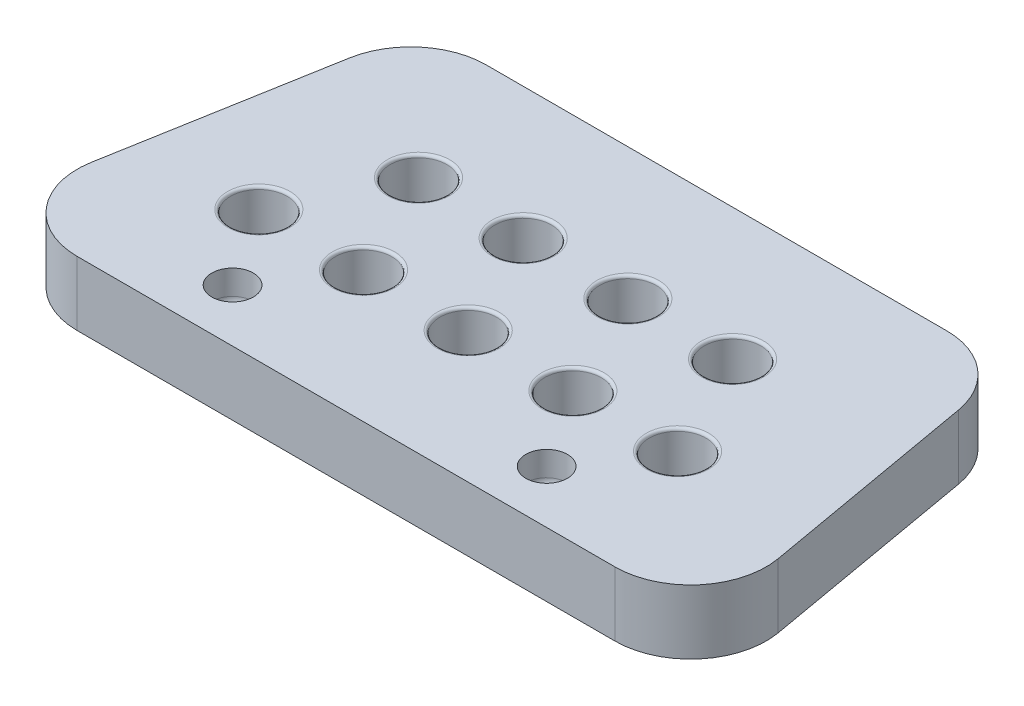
ISO-10303-21;
HEADER;
FILE_DESCRIPTION(('STEP AP214'),'2;1');
FILE_NAME('part.step','',(''),(''),'','','');
FILE_SCHEMA(('AUTOMOTIVE_DESIGN { 1 0 10303 214 1 1 1 1 }'));
ENDSEC;
DATA;
#1=APPLICATION_CONTEXT('core data for automotive mechanical design processes');
#2=APPLICATION_PROTOCOL_DEFINITION('international standard','automotive_design',2000,#1);
#3=PRODUCT_CONTEXT('',#1,'mechanical');
#4=PRODUCT('Part','Part','',(#3));
#5=PRODUCT_RELATED_PRODUCT_CATEGORY('part','',(#4));
#6=PRODUCT_DEFINITION_FORMATION('','',#4);
#7=PRODUCT_DEFINITION_CONTEXT('part definition',#1,'design');
#8=PRODUCT_DEFINITION('design','',#6,#7);
#9=PRODUCT_DEFINITION_SHAPE('','',#8);
#10=(LENGTH_UNIT() NAMED_UNIT(*) SI_UNIT(.MILLI.,.METRE.));
#11=(NAMED_UNIT(*) PLANE_ANGLE_UNIT() SI_UNIT($,.RADIAN.));
#12=(NAMED_UNIT(*) SI_UNIT($,.STERADIAN.) SOLID_ANGLE_UNIT());
#13=UNCERTAINTY_MEASURE_WITH_UNIT(LENGTH_MEASURE(1.E-05),#10,'distance_accuracy_value','');
#14=(GEOMETRIC_REPRESENTATION_CONTEXT(3) GLOBAL_UNCERTAINTY_ASSIGNED_CONTEXT((#13)) GLOBAL_UNIT_ASSIGNED_CONTEXT((#10,
#11,#12)) REPRESENTATION_CONTEXT('',''));
#15=CARTESIAN_POINT('',(0.,0.,0.));
#16=DIRECTION('',(0.,0.,1.));
#17=DIRECTION('',(1.,0.,0.));
#18=AXIS2_PLACEMENT_3D('',#15,#16,#17);
#19=CARTESIAN_POINT('',(-7.74413500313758,-5.15,2.78906652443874));
#20=DIRECTION('',(-0.17364817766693,0.,0.984807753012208));
#21=DIRECTION('',(0.984807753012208,0.,0.17364817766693));
#22=AXIS2_PLACEMENT_3D('',#19,#20,#21);
#23=CYLINDRICAL_SURFACE('',#22,0.1);
#24=CARTESIAN_POINT('',(-6.87292871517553,-5.15,-2.15178985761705));
#25=DIRECTION('',(-0.173648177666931,0.,0.984807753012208));
#26=DIRECTION('',(-0.984807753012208,0.,-0.173648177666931));
#27=AXIS2_PLACEMENT_3D('',#24,#25,#26);
#28=CIRCLE('',#27,0.1);
#29=CARTESIAN_POINT('',(-6.87292871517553,-5.25,-2.15178985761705));
#30=VERTEX_POINT('',#29);
#31=CARTESIAN_POINT('',(-6.97140949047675,-5.15,-2.16915467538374));
#32=VERTEX_POINT('',#31);
#33=EDGE_CURVE('E343',#30,#32,#28,.F.);
#34=ORIENTED_EDGE('',*,*,#33,.F.);
#35=DIRECTION('',(-0.173648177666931,0.,0.984807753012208));
#36=VECTOR('',#35,1.);
#37=CARTESIAN_POINT('',(-6.87292871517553,-5.25,-2.15178985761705));
#38=LINE('',#37,#36);
#39=CARTESIAN_POINT('',(-7.5429712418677,-5.25,1.64821014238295));
#40=VERTEX_POINT('',#39);
#41=EDGE_CURVE('E227',#30,#40,#38,.T.);
#42=ORIENTED_EDGE('',*,*,#41,.T.);
#43=CARTESIAN_POINT('',(-7.5429712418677,-5.15,1.64821014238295));
#44=DIRECTION('',(-0.173648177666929,0.,0.984807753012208));
#45=DIRECTION('',(-0.984807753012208,0.,-0.173648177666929));
#46=AXIS2_PLACEMENT_3D('',#43,#44,#45);
#47=CIRCLE('',#46,0.1);
#48=CARTESIAN_POINT('',(-7.64145201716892,-5.15,1.63084532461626));
#49=VERTEX_POINT('',#48);
#50=EDGE_CURVE('E408',#49,#40,#47,.T.);
#51=ORIENTED_EDGE('',*,*,#50,.F.);
#52=DIRECTION('',(-0.173648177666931,0.,0.984807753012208));
#53=VECTOR('',#52,1.);
#54=CARTESIAN_POINT('',(-7.64145201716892,-5.15,1.63084532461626));
#55=LINE('',#54,#53);
#56=EDGE_CURVE('E130',#32,#49,#55,.T.);
#57=ORIENTED_EDGE('',*,*,#56,.F.);
#58=EDGE_LOOP('',(#34,#42,#51,#57));
#59=FACE_BOUND('',#58,.T.);
#60=ADVANCED_FACE('F19',(#59),#23,.T.);
#61=CARTESIAN_POINT('',(-6.115,-5.15,1.9));
#62=DIRECTION('',(0.,1.,0.));
#63=DIRECTION('',(0.,0.,1.));
#64=AXIS2_PLACEMENT_3D('',#61,#62,#63);
#65=TOROIDAL_SURFACE('',#64,1.45,0.1);
#66=ORIENTED_EDGE('',*,*,#50,.T.);
#67=CARTESIAN_POINT('',(-6.115,-5.25,1.9));
#68=DIRECTION('',(0.,1.,0.));
#69=DIRECTION('',(-0.984807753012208,0.,-0.17364817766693));
#70=AXIS2_PLACEMENT_3D('',#67,#68,#69);
#71=CIRCLE('',#70,1.45);
#72=CARTESIAN_POINT('',(-6.115,-5.25,3.35));
#73=VERTEX_POINT('',#72);
#74=EDGE_CURVE('E168',#40,#73,#71,.T.);
#75=ORIENTED_EDGE('',*,*,#74,.T.);
#76=CARTESIAN_POINT('',(-6.115,-5.15,3.35));
#77=DIRECTION('',(1.,0.,0.));
#78=DIRECTION('',(0.,0.,-1.));
#79=AXIS2_PLACEMENT_3D('',#76,#77,#78);
#80=CIRCLE('',#79,0.1);
#81=CARTESIAN_POINT('',(-6.115,-5.15,3.45));
#82=VERTEX_POINT('',#81);
#83=EDGE_CURVE('E403',#82,#73,#80,.T.);
#84=ORIENTED_EDGE('',*,*,#83,.F.);
#85=CARTESIAN_POINT('',(-6.115,-5.15,1.9));
#86=DIRECTION('',(0.,-1.,0.));
#87=DIRECTION('',(0.,0.,-1.));
#88=AXIS2_PLACEMENT_3D('',#85,#86,#87);
#89=CIRCLE('',#88,1.55);
#90=EDGE_CURVE('E317',#49,#82,#89,.F.);
#91=ORIENTED_EDGE('',*,*,#90,.F.);
#92=EDGE_LOOP('',(#66,#75,#84,#91));
#93=FACE_BOUND('',#92,.T.);
#94=ADVANCED_FACE('F414',(#93),#65,.T.);
#95=CARTESIAN_POINT('',(-7.115,-5.15,3.35));
#96=DIRECTION('',(1.,0.,0.));
#97=DIRECTION('',(0.,0.,-1.));
#98=AXIS2_PLACEMENT_3D('',#95,#96,#97);
#99=CYLINDRICAL_SURFACE('',#98,0.1);
#100=ORIENTED_EDGE('',*,*,#83,.T.);
#101=DIRECTION('',(1.,0.,0.));
#102=VECTOR('',#101,1.);
#103=CARTESIAN_POINT('',(-7.115,-5.25,3.35));
#104=LINE('',#103,#102);
#105=CARTESIAN_POINT('',(6.115,-5.25,3.35));
#106=VERTEX_POINT('',#105);
#107=EDGE_CURVE('E245',#73,#106,#104,.T.);
#108=ORIENTED_EDGE('',*,*,#107,.T.);
#109=CARTESIAN_POINT('',(6.115,-5.15,3.35));
#110=DIRECTION('',(1.,0.,0.));
#111=DIRECTION('',(0.,0.,1.));
#112=AXIS2_PLACEMENT_3D('',#109,#110,#111);
#113=CIRCLE('',#112,0.1);
#114=CARTESIAN_POINT('',(6.115,-5.15,3.45));
#115=VERTEX_POINT('',#114);
#116=EDGE_CURVE('E379',#115,#106,#113,.T.);
#117=ORIENTED_EDGE('',*,*,#116,.F.);
#118=DIRECTION('',(1.,0.,0.));
#119=VECTOR('',#118,1.);
#120=CARTESIAN_POINT('',(6.115,-5.15,3.45));
#121=LINE('',#120,#119);
#122=EDGE_CURVE('E342',#82,#115,#121,.T.);
#123=ORIENTED_EDGE('',*,*,#122,.F.);
#124=EDGE_LOOP('',(#100,#108,#117,#123));
#125=FACE_BOUND('',#124,.T.);
#126=ADVANCED_FACE('F390',(#125),#99,.T.);
#127=CARTESIAN_POINT('',(6.115,-5.15,1.9));
#128=DIRECTION('',(0.,1.,0.));
#129=DIRECTION('',(0.,0.,1.));
#130=AXIS2_PLACEMENT_3D('',#127,#128,#129);
#131=TOROIDAL_SURFACE('',#130,1.45,0.1);
#132=CARTESIAN_POINT('',(7.5429712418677,-5.15,1.64821014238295));
#133=DIRECTION('',(-0.17364817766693,0.,-0.984807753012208));
#134=DIRECTION('',(-0.984807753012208,0.,0.17364817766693));
#135=AXIS2_PLACEMENT_3D('',#132,#133,#134);
#136=CIRCLE('',#135,0.1);
#137=CARTESIAN_POINT('',(7.64145201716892,-5.15,1.63084532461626));
#138=VERTEX_POINT('',#137);
#139=CARTESIAN_POINT('',(7.5429712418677,-5.25,1.64821014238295));
#140=VERTEX_POINT('',#139);
#141=EDGE_CURVE('E374',#138,#140,#136,.T.);
#142=ORIENTED_EDGE('',*,*,#141,.F.);
#143=CARTESIAN_POINT('',(6.115,-5.15,1.9));
#144=DIRECTION('',(0.,-1.,0.));
#145=DIRECTION('',(0.,0.,-1.));
#146=AXIS2_PLACEMENT_3D('',#143,#144,#145);
#147=CIRCLE('',#146,1.55);
#148=EDGE_CURVE('E284',#115,#138,#147,.F.);
#149=ORIENTED_EDGE('',*,*,#148,.F.);
#150=ORIENTED_EDGE('',*,*,#116,.T.);
#151=CARTESIAN_POINT('',(6.115,-5.25,1.9));
#152=DIRECTION('',(0.,1.,0.));
#153=DIRECTION('',(0.,0.,1.));
#154=AXIS2_PLACEMENT_3D('',#151,#152,#153);
#155=CIRCLE('',#154,1.45);
#156=EDGE_CURVE('E242',#106,#140,#155,.T.);
#157=ORIENTED_EDGE('',*,*,#156,.T.);
#158=EDGE_LOOP('',(#142,#149,#150,#157));
#159=FACE_BOUND('',#158,.T.);
#160=ADVANCED_FACE('F386',(#159),#131,.T.);
#161=CARTESIAN_POINT('',(7.31504800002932,-5.15,0.355593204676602));
#162=DIRECTION('',(-0.17364817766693,0.,-0.984807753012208));
#163=DIRECTION('',(-0.984807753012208,0.,0.17364817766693));
#164=AXIS2_PLACEMENT_3D('',#161,#162,#163);
#165=CYLINDRICAL_SURFACE('',#164,0.1);
#166=CARTESIAN_POINT('',(6.87292871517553,-5.15,-2.15178985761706));
#167=DIRECTION('',(-0.173648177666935,0.,-0.984807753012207));
#168=DIRECTION('',(0.984807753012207,0.,-0.173648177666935));
#169=AXIS2_PLACEMENT_3D('',#166,#167,#168);
#170=CIRCLE('',#169,0.1);
#171=CARTESIAN_POINT('',(6.97140949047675,-5.15,-2.16915467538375));
#172=VERTEX_POINT('',#171);
#173=CARTESIAN_POINT('',(6.87292871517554,-5.25,-2.15178985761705));
#174=VERTEX_POINT('',#173);
#175=EDGE_CURVE('E351',#172,#174,#170,.T.);
#176=ORIENTED_EDGE('',*,*,#175,.F.);
#177=DIRECTION('',(-0.173648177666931,0.,-0.984807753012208));
#178=VECTOR('',#177,1.);
#179=CARTESIAN_POINT('',(6.97140949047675,-5.15,-2.16915467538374));
#180=LINE('',#179,#178);
#181=EDGE_CURVE('E295',#138,#172,#180,.T.);
#182=ORIENTED_EDGE('',*,*,#181,.F.);
#183=ORIENTED_EDGE('',*,*,#141,.T.);
#184=DIRECTION('',(-0.173648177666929,0.,-0.984807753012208));
#185=VECTOR('',#184,1.);
#186=CARTESIAN_POINT('',(7.5429712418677,-5.25,1.64821014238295));
#187=LINE('',#186,#185);
#188=EDGE_CURVE('E236',#140,#174,#187,.T.);
#189=ORIENTED_EDGE('',*,*,#188,.T.);
#190=EDGE_LOOP('',(#176,#182,#183,#189));
#191=FACE_BOUND('',#190,.T.);
#192=ADVANCED_FACE('F361',(#191),#165,.T.);
#193=CARTESIAN_POINT('',(5.44495747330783,-5.15,-1.9));
#194=DIRECTION('',(0.,1.,0.));
#195=DIRECTION('',(0.,0.,1.));
#196=AXIS2_PLACEMENT_3D('',#193,#194,#195);
#197=TOROIDAL_SURFACE('',#196,1.45,0.1);
#198=CARTESIAN_POINT('',(5.44495747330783,-5.15,-3.35));
#199=DIRECTION('',(-1.,0.,0.));
#200=DIRECTION('',(0.,0.,1.));
#201=AXIS2_PLACEMENT_3D('',#198,#199,#200);
#202=CIRCLE('',#201,0.1);
#203=CARTESIAN_POINT('',(5.44495747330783,-5.15,-3.45));
#204=VERTEX_POINT('',#203);
#205=CARTESIAN_POINT('',(5.44495747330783,-5.25,-3.35));
#206=VERTEX_POINT('',#205);
#207=EDGE_CURVE('E347',#204,#206,#202,.T.);
#208=ORIENTED_EDGE('',*,*,#207,.F.);
#209=CARTESIAN_POINT('',(5.44495747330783,-5.15,-1.9));
#210=DIRECTION('',(0.,-1.,0.));
#211=DIRECTION('',(0.,0.,-1.));
#212=AXIS2_PLACEMENT_3D('',#209,#210,#211);
#213=CIRCLE('',#212,1.55);
#214=EDGE_CURVE('E301',#172,#204,#213,.F.);
#215=ORIENTED_EDGE('',*,*,#214,.F.);
#216=ORIENTED_EDGE('',*,*,#175,.T.);
#217=CARTESIAN_POINT('',(5.44495747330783,-5.25,-1.9));
#218=DIRECTION('',(0.,1.,0.));
#219=DIRECTION('',(0.984807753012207,0.,-0.173648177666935));
#220=AXIS2_PLACEMENT_3D('',#217,#218,#219);
#221=CIRCLE('',#220,1.45);
#222=EDGE_CURVE('E212',#174,#206,#221,.T.);
#223=ORIENTED_EDGE('',*,*,#222,.T.);
#224=EDGE_LOOP('',(#208,#215,#216,#223));
#225=FACE_BOUND('',#224,.T.);
#226=ADVANCED_FACE('F357',(#225),#197,.T.);
#227=CARTESIAN_POINT('',(-7.115,-5.15,-3.35));
#228=DIRECTION('',(-1.,0.,0.));
#229=DIRECTION('',(0.,0.,1.));
#230=AXIS2_PLACEMENT_3D('',#227,#228,#229);
#231=CYLINDRICAL_SURFACE('',#230,0.1);
#232=ORIENTED_EDGE('',*,*,#207,.T.);
#233=DIRECTION('',(1.,0.,0.));
#234=VECTOR('',#233,1.);
#235=CARTESIAN_POINT('',(-7.115,-5.25,-3.35));
#236=LINE('',#235,#234);
#237=CARTESIAN_POINT('',(-5.44495747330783,-5.25,-3.35));
#238=VERTEX_POINT('',#237);
#239=EDGE_CURVE('E224',#206,#238,#236,.F.);
#240=ORIENTED_EDGE('',*,*,#239,.T.);
#241=CARTESIAN_POINT('',(-5.44495747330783,-5.15,-3.35));
#242=DIRECTION('',(-1.,0.,0.));
#243=DIRECTION('',(0.,0.,-1.));
#244=AXIS2_PLACEMENT_3D('',#241,#242,#243);
#245=CIRCLE('',#244,0.1);
#246=CARTESIAN_POINT('',(-5.44495747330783,-5.15,-3.45));
#247=VERTEX_POINT('',#246);
#248=EDGE_CURVE('E335',#247,#238,#245,.T.);
#249=ORIENTED_EDGE('',*,*,#248,.F.);
#250=DIRECTION('',(-1.,0.,0.));
#251=VECTOR('',#250,1.);
#252=CARTESIAN_POINT('',(-5.44495747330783,-5.15,-3.45));
#253=LINE('',#252,#251);
#254=EDGE_CURVE('E307',#204,#247,#253,.T.);
#255=ORIENTED_EDGE('',*,*,#254,.F.);
#256=EDGE_LOOP('',(#232,#240,#249,#255));
#257=FACE_BOUND('',#256,.T.);
#258=ADVANCED_FACE('F329',(#257),#231,.T.);
#259=CARTESIAN_POINT('',(-5.44495747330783,-5.15,-1.9));
#260=DIRECTION('',(0.,1.,0.));
#261=DIRECTION('',(0.,0.,1.));
#262=AXIS2_PLACEMENT_3D('',#259,#260,#261);
#263=TOROIDAL_SURFACE('',#262,1.45,0.1);
#264=ORIENTED_EDGE('',*,*,#248,.T.);
#265=CARTESIAN_POINT('',(-5.44495747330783,-5.25,-1.9));
#266=DIRECTION('',(0.,1.,0.));
#267=DIRECTION('',(0.,0.,-1.));
#268=AXIS2_PLACEMENT_3D('',#265,#266,#267);
#269=CIRCLE('',#268,1.45);
#270=EDGE_CURVE('E145',#238,#30,#269,.T.);
#271=ORIENTED_EDGE('',*,*,#270,.T.);
#272=ORIENTED_EDGE('',*,*,#33,.T.);
#273=CARTESIAN_POINT('',(-5.44495747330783,-5.15,-1.9));
#274=DIRECTION('',(0.,-1.,0.));
#275=DIRECTION('',(0.,0.,-1.));
#276=AXIS2_PLACEMENT_3D('',#273,#274,#275);
#277=CIRCLE('',#276,1.55);
#278=EDGE_CURVE('E131',#247,#32,#277,.F.);
#279=ORIENTED_EDGE('',*,*,#278,.F.);
#280=EDGE_LOOP('',(#264,#271,#272,#279));
#281=FACE_BOUND('',#280,.T.);
#282=ADVANCED_FACE('F323',(#281),#263,.T.);
#283=CARTESIAN_POINT('',(6.115,-4.,3.45));
#284=DIRECTION('',(0.,0.,1.));
#285=DIRECTION('',(1.,0.,0.));
#286=AXIS2_PLACEMENT_3D('',#283,#284,#285);
#287=PLANE('',#286);
#288=DIRECTION('',(0.,-1.,0.));
#289=VECTOR('',#288,1.);
#290=CARTESIAN_POINT('',(6.115,-4.,3.45));
#291=LINE('',#290,#289);
#292=CARTESIAN_POINT('',(6.115,-4.,3.45));
#293=VERTEX_POINT('',#292);
#294=EDGE_CURVE('E287',#293,#115,#291,.T.);
#295=ORIENTED_EDGE('',*,*,#294,.F.);
#296=DIRECTION('',(1.,0.,0.));
#297=VECTOR('',#296,1.);
#298=CARTESIAN_POINT('',(-7.115,-4.,3.45));
#299=LINE('',#298,#297);
#300=CARTESIAN_POINT('',(-6.115,-4.,3.45));
#301=VERTEX_POINT('',#300);
#302=EDGE_CURVE('E109',#293,#301,#299,.F.);
#303=ORIENTED_EDGE('',*,*,#302,.T.);
#304=DIRECTION('',(0.,-1.,0.));
#305=VECTOR('',#304,1.);
#306=CARTESIAN_POINT('',(-6.115,-4.,3.45));
#307=LINE('',#306,#305);
#308=EDGE_CURVE('E121',#82,#301,#307,.F.);
#309=ORIENTED_EDGE('',*,*,#308,.F.);
#310=ORIENTED_EDGE('',*,*,#122,.T.);
#311=EDGE_LOOP('',(#295,#303,#309,#310));
#312=FACE_BOUND('',#311,.T.);
#313=ADVANCED_FACE('F328',(#312),#287,.T.);
#314=CARTESIAN_POINT('',(-6.115,-4.,1.9));
#315=DIRECTION('',(0.,-1.,0.));
#316=DIRECTION('',(0.,0.,-1.));
#317=AXIS2_PLACEMENT_3D('',#314,#315,#316);
#318=CYLINDRICAL_SURFACE('',#317,1.55);
#319=ORIENTED_EDGE('',*,*,#308,.T.);
#320=CARTESIAN_POINT('',(-6.115,-4.,1.9));
#321=DIRECTION('',(0.,-1.,0.));
#322=DIRECTION('',(0.,0.,-1.));
#323=AXIS2_PLACEMENT_3D('',#320,#321,#322);
#324=CIRCLE('',#323,1.55);
#325=CARTESIAN_POINT('',(-7.64145201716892,-4.,1.63084532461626));
#326=VERTEX_POINT('',#325);
#327=EDGE_CURVE('E23',#301,#326,#324,.T.);
#328=ORIENTED_EDGE('',*,*,#327,.T.);
#329=DIRECTION('',(0.,1.,0.));
#330=VECTOR('',#329,1.);
#331=CARTESIAN_POINT('',(-7.64145201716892,-4.,1.63084532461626));
#332=LINE('',#331,#330);
#333=EDGE_CURVE('E119',#49,#326,#332,.T.);
#334=ORIENTED_EDGE('',*,*,#333,.F.);
#335=ORIENTED_EDGE('',*,*,#90,.T.);
#336=EDGE_LOOP('',(#319,#328,#334,#335));
#337=FACE_BOUND('',#336,.T.);
#338=ADVANCED_FACE('F116',(#337),#318,.T.);
#339=CARTESIAN_POINT('',(-7.64145201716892,-4.,1.63084532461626));
#340=DIRECTION('',(-0.984807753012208,0.,-0.173648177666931));
#341=DIRECTION('',(-0.173648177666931,0.,0.984807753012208));
#342=AXIS2_PLACEMENT_3D('',#339,#340,#341);
#343=PLANE('',#342);
#344=ORIENTED_EDGE('',*,*,#333,.T.);
#345=DIRECTION('',(0.173648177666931,0.,-0.984807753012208));
#346=VECTOR('',#345,1.);
#347=CARTESIAN_POINT('',(-7.64145201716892,-4.,1.63084532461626));
#348=LINE('',#347,#346);
#349=CARTESIAN_POINT('',(-6.97140949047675,-4.,-2.16915467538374));
#350=VERTEX_POINT('',#349);
#351=EDGE_CURVE('E124',#326,#350,#348,.T.);
#352=ORIENTED_EDGE('',*,*,#351,.T.);
#353=DIRECTION('',(0.,-1.,0.));
#354=VECTOR('',#353,1.);
#355=CARTESIAN_POINT('',(-6.97140949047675,-4.,-2.16915467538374));
#356=LINE('',#355,#354);
#357=EDGE_CURVE('E310',#32,#350,#356,.F.);
#358=ORIENTED_EDGE('',*,*,#357,.F.);
#359=ORIENTED_EDGE('',*,*,#56,.T.);
#360=EDGE_LOOP('',(#344,#352,#358,#359));
#361=FACE_BOUND('',#360,.T.);
#362=ADVANCED_FACE('F126',(#361),#343,.T.);
#363=CARTESIAN_POINT('',(-5.44495747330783,-4.,-1.9));
#364=DIRECTION('',(0.,-1.,0.));
#365=DIRECTION('',(0.,0.,-1.));
#366=AXIS2_PLACEMENT_3D('',#363,#364,#365);
#367=CYLINDRICAL_SURFACE('',#366,1.55);
#368=ORIENTED_EDGE('',*,*,#357,.T.);
#369=CARTESIAN_POINT('',(-5.44495747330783,-4.,-1.9));
#370=DIRECTION('',(0.,-1.,0.));
#371=DIRECTION('',(0.,0.,-1.));
#372=AXIS2_PLACEMENT_3D('',#369,#370,#371);
#373=CIRCLE('',#372,1.55);
#374=CARTESIAN_POINT('',(-5.44495747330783,-4.,-3.45));
#375=VERTEX_POINT('',#374);
#376=EDGE_CURVE('E138',#350,#375,#373,.T.);
#377=ORIENTED_EDGE('',*,*,#376,.T.);
#378=DIRECTION('',(0.,1.,0.));
#379=VECTOR('',#378,1.);
#380=CARTESIAN_POINT('',(-5.44495747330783,-4.,-3.45));
#381=LINE('',#380,#379);
#382=EDGE_CURVE('E304',#247,#375,#381,.T.);
#383=ORIENTED_EDGE('',*,*,#382,.F.);
#384=ORIENTED_EDGE('',*,*,#278,.T.);
#385=EDGE_LOOP('',(#368,#377,#383,#384));
#386=FACE_BOUND('',#385,.T.);
#387=ADVANCED_FACE('F585',(#386),#367,.T.);
#388=CARTESIAN_POINT('',(-5.44495747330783,-4.,-3.45));
#389=DIRECTION('',(0.,0.,-1.));
#390=DIRECTION('',(-1.,0.,0.));
#391=AXIS2_PLACEMENT_3D('',#388,#389,#390);
#392=PLANE('',#391);
#393=ORIENTED_EDGE('',*,*,#382,.T.);
#394=DIRECTION('',(1.,0.,0.));
#395=VECTOR('',#394,1.);
#396=CARTESIAN_POINT('',(-7.115,-4.,-3.45));
#397=LINE('',#396,#395);
#398=CARTESIAN_POINT('',(5.44495747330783,-4.,-3.45));
#399=VERTEX_POINT('',#398);
#400=EDGE_CURVE('E140',#375,#399,#397,.T.);
#401=ORIENTED_EDGE('',*,*,#400,.T.);
#402=DIRECTION('',(0.,-1.,0.));
#403=VECTOR('',#402,1.);
#404=CARTESIAN_POINT('',(5.44495747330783,-4.,-3.45));
#405=LINE('',#404,#403);
#406=EDGE_CURVE('E298',#204,#399,#405,.F.);
#407=ORIENTED_EDGE('',*,*,#406,.F.);
#408=ORIENTED_EDGE('',*,*,#254,.T.);
#409=EDGE_LOOP('',(#393,#401,#407,#408));
#410=FACE_BOUND('',#409,.T.);
#411=ADVANCED_FACE('F535',(#410),#392,.T.);
#412=CARTESIAN_POINT('',(5.44495747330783,-4.,-1.9));
#413=DIRECTION('',(0.,-1.,0.));
#414=DIRECTION('',(0.,0.,-1.));
#415=AXIS2_PLACEMENT_3D('',#412,#413,#414);
#416=CYLINDRICAL_SURFACE('',#415,1.55);
#417=ORIENTED_EDGE('',*,*,#406,.T.);
#418=CARTESIAN_POINT('',(5.44495747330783,-4.,-1.9));
#419=DIRECTION('',(0.,-1.,0.));
#420=DIRECTION('',(0.,0.,-1.));
#421=AXIS2_PLACEMENT_3D('',#418,#419,#420);
#422=CIRCLE('',#421,1.55);
#423=CARTESIAN_POINT('',(6.97140949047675,-4.,-2.16915467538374));
#424=VERTEX_POINT('',#423);
#425=EDGE_CURVE('E529',#399,#424,#422,.T.);
#426=ORIENTED_EDGE('',*,*,#425,.T.);
#427=DIRECTION('',(0.,1.,0.));
#428=VECTOR('',#427,1.);
#429=CARTESIAN_POINT('',(6.97140949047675,-4.,-2.16915467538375));
#430=LINE('',#429,#428);
#431=EDGE_CURVE('E290',#172,#424,#430,.T.);
#432=ORIENTED_EDGE('',*,*,#431,.F.);
#433=ORIENTED_EDGE('',*,*,#214,.T.);
#434=EDGE_LOOP('',(#417,#426,#432,#433));
#435=FACE_BOUND('',#434,.T.);
#436=ADVANCED_FACE('F538',(#435),#416,.T.);
#437=CARTESIAN_POINT('',(6.97140949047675,-4.,-2.16915467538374));
#438=DIRECTION('',(0.984807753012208,0.,-0.173648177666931));
#439=DIRECTION('',(-0.173648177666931,0.,-0.984807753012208));
#440=AXIS2_PLACEMENT_3D('',#437,#438,#439);
#441=PLANE('',#440);
#442=ORIENTED_EDGE('',*,*,#431,.T.);
#443=DIRECTION('',(0.173648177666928,0.,0.984807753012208));
#444=VECTOR('',#443,1.);
#445=CARTESIAN_POINT('',(6.97140949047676,-4.,-2.16915467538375));
#446=LINE('',#445,#444);
#447=CARTESIAN_POINT('',(7.64145201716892,-4.,1.63084532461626));
#448=VERTEX_POINT('',#447);
#449=EDGE_CURVE('E528',#424,#448,#446,.T.);
#450=ORIENTED_EDGE('',*,*,#449,.T.);
#451=DIRECTION('',(0.,-1.,0.));
#452=VECTOR('',#451,1.);
#453=CARTESIAN_POINT('',(7.64145201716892,-4.,1.63084532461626));
#454=LINE('',#453,#452);
#455=EDGE_CURVE('E251',#138,#448,#454,.F.);
#456=ORIENTED_EDGE('',*,*,#455,.F.);
#457=ORIENTED_EDGE('',*,*,#181,.T.);
#458=EDGE_LOOP('',(#442,#450,#456,#457));
#459=FACE_BOUND('',#458,.T.);
#460=ADVANCED_FACE('F543',(#459),#441,.T.);
#461=CARTESIAN_POINT('',(6.115,-4.,1.9));
#462=DIRECTION('',(0.,-1.,0.));
#463=DIRECTION('',(0.,0.,-1.));
#464=AXIS2_PLACEMENT_3D('',#461,#462,#463);
#465=CYLINDRICAL_SURFACE('',#464,1.55);
#466=ORIENTED_EDGE('',*,*,#455,.T.);
#467=CARTESIAN_POINT('',(6.115,-4.,1.9));
#468=DIRECTION('',(0.,-1.,0.));
#469=DIRECTION('',(0.,0.,-1.));
#470=AXIS2_PLACEMENT_3D('',#467,#468,#469);
#471=CIRCLE('',#470,1.55);
#472=EDGE_CURVE('E525',#448,#293,#471,.T.);
#473=ORIENTED_EDGE('',*,*,#472,.T.);
#474=ORIENTED_EDGE('',*,*,#294,.T.);
#475=ORIENTED_EDGE('',*,*,#148,.T.);
#476=EDGE_LOOP('',(#466,#473,#474,#475));
#477=FACE_BOUND('',#476,.T.);
#478=ADVANCED_FACE('F186',(#477),#465,.T.);
#479=CARTESIAN_POINT('',(-7.115,-5.25,2.9));
#480=DIRECTION('',(0.,1.,0.));
#481=DIRECTION('',(0.,0.,1.));
#482=AXIS2_PLACEMENT_3D('',#479,#480,#481);
#483=PLANE('',#482);
#484=CARTESIAN_POINT('',(-3.02,-5.25,1.42));
#485=DIRECTION('',(0.,1.,0.));
#486=DIRECTION('',(0.,0.,1.));
#487=AXIS2_PLACEMENT_3D('',#484,#485,#486);
#488=CIRCLE('',#487,0.75);
#489=CARTESIAN_POINT('',(-3.02,-5.25,2.17));
#490=VERTEX_POINT('',#489);
#491=EDGE_CURVE('E522',#490,#490,#488,.T.);
#492=ORIENTED_EDGE('',*,*,#491,.T.);
#493=EDGE_LOOP('',(#492));
#494=FACE_BOUND('',#493,.T.);
#495=CARTESIAN_POINT('',(-5.79,-5.25,1.42));
#496=DIRECTION('',(0.,1.,0.));
#497=DIRECTION('',(0.,0.,1.));
#498=AXIS2_PLACEMENT_3D('',#495,#496,#497);
#499=CIRCLE('',#498,0.75);
#500=CARTESIAN_POINT('',(-5.79,-5.25,2.17));
#501=VERTEX_POINT('',#500);
#502=EDGE_CURVE('E498',#501,#501,#499,.T.);
#503=ORIENTED_EDGE('',*,*,#502,.T.);
#504=EDGE_LOOP('',(#503));
#505=FACE_BOUND('',#504,.T.);
#506=CARTESIAN_POINT('',(2.52,-5.25,1.42));
#507=DIRECTION('',(0.,1.,0.));
#508=DIRECTION('',(0.,0.,1.));
#509=AXIS2_PLACEMENT_3D('',#506,#507,#508);
#510=CIRCLE('',#509,0.75);
#511=CARTESIAN_POINT('',(2.52,-5.25,2.17));
#512=VERTEX_POINT('',#511);
#513=EDGE_CURVE('E516',#512,#512,#510,.T.);
#514=ORIENTED_EDGE('',*,*,#513,.T.);
#515=EDGE_LOOP('',(#514));
#516=FACE_BOUND('',#515,.T.);
#517=CARTESIAN_POINT('',(5.29,-5.25,1.42));
#518=DIRECTION('',(0.,1.,0.));
#519=DIRECTION('',(0.,0.,1.));
#520=AXIS2_PLACEMENT_3D('',#517,#518,#519);
#521=CIRCLE('',#520,0.75);
#522=CARTESIAN_POINT('',(5.29,-5.25,2.17));
#523=VERTEX_POINT('',#522);
#524=EDGE_CURVE('E513',#523,#523,#521,.T.);
#525=ORIENTED_EDGE('',*,*,#524,.T.);
#526=EDGE_LOOP('',(#525));
#527=FACE_BOUND('',#526,.T.);
#528=CARTESIAN_POINT('',(3.905,-5.25,-1.42));
#529=DIRECTION('',(0.,1.,0.));
#530=DIRECTION('',(0.,0.,1.));
#531=AXIS2_PLACEMENT_3D('',#528,#529,#530);
#532=CIRCLE('',#531,0.75);
#533=CARTESIAN_POINT('',(3.905,-5.25,-0.67));
#534=VERTEX_POINT('',#533);
#535=EDGE_CURVE('E510',#534,#534,#532,.T.);
#536=ORIENTED_EDGE('',*,*,#535,.T.);
#537=EDGE_LOOP('',(#536));
#538=FACE_BOUND('',#537,.T.);
#539=CARTESIAN_POINT('',(1.135,-5.25,-1.42));
#540=DIRECTION('',(0.,1.,0.));
#541=DIRECTION('',(0.,0.,1.));
#542=AXIS2_PLACEMENT_3D('',#539,#540,#541);
#543=CIRCLE('',#542,0.75);
#544=CARTESIAN_POINT('',(1.135,-5.25,-0.67));
#545=VERTEX_POINT('',#544);
#546=EDGE_CURVE('E507',#545,#545,#543,.T.);
#547=ORIENTED_EDGE('',*,*,#546,.T.);
#548=EDGE_LOOP('',(#547));
#549=FACE_BOUND('',#548,.T.);
#550=CARTESIAN_POINT('',(-1.635,-5.25,-1.42));
#551=DIRECTION('',(0.,1.,0.));
#552=DIRECTION('',(0.,0.,1.));
#553=AXIS2_PLACEMENT_3D('',#550,#551,#552);
#554=CIRCLE('',#553,0.75);
#555=CARTESIAN_POINT('',(-1.635,-5.25,-0.67));
#556=VERTEX_POINT('',#555);
#557=EDGE_CURVE('E504',#556,#556,#554,.T.);
#558=ORIENTED_EDGE('',*,*,#557,.T.);
#559=EDGE_LOOP('',(#558));
#560=FACE_BOUND('',#559,.T.);
#561=CARTESIAN_POINT('',(-4.405,-5.25,-1.42));
#562=DIRECTION('',(0.,1.,0.));
#563=DIRECTION('',(0.,0.,1.));
#564=AXIS2_PLACEMENT_3D('',#561,#562,#563);
#565=CIRCLE('',#564,0.75);
#566=CARTESIAN_POINT('',(-4.405,-5.25,-0.67));
#567=VERTEX_POINT('',#566);
#568=EDGE_CURVE('E501',#567,#567,#565,.T.);
#569=ORIENTED_EDGE('',*,*,#568,.T.);
#570=EDGE_LOOP('',(#569));
#571=FACE_BOUND('',#570,.T.);
#572=CARTESIAN_POINT('',(-0.250000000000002,-5.25,1.42));
#573=DIRECTION('',(0.,1.,0.));
#574=DIRECTION('',(0.,0.,1.));
#575=AXIS2_PLACEMENT_3D('',#572,#573,#574);
#576=CIRCLE('',#575,0.75);
#577=CARTESIAN_POINT('',(-0.250000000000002,-5.25,2.17));
#578=VERTEX_POINT('',#577);
#579=EDGE_CURVE('E519',#578,#578,#576,.T.);
#580=ORIENTED_EDGE('',*,*,#579,.T.);
#581=EDGE_LOOP('',(#580));
#582=FACE_BOUND('',#581,.T.);
#583=ORIENTED_EDGE('',*,*,#239,.F.);
#584=ORIENTED_EDGE('',*,*,#222,.F.);
#585=ORIENTED_EDGE('',*,*,#188,.F.);
#586=ORIENTED_EDGE('',*,*,#156,.F.);
#587=ORIENTED_EDGE('',*,*,#107,.F.);
#588=ORIENTED_EDGE('',*,*,#74,.F.);
#589=ORIENTED_EDGE('',*,*,#41,.F.);
#590=ORIENTED_EDGE('',*,*,#270,.F.);
#591=EDGE_LOOP('',(#583,#584,#585,#586,#587,#588,#589,#590));
#592=FACE_BOUND('',#591,.T.);
#593=ADVANCED_FACE('F175',(#494,#505,#516,#527,#538,#549,#560,#571,#582,#592),#483,.F.);
#594=CARTESIAN_POINT('',(-4.405,-3.25,3.5));
#595=DIRECTION('',(0.,1.,0.));
#596=DIRECTION('',(0.,0.,1.));
#597=AXIS2_PLACEMENT_3D('',#594,#595,#596);
#598=PLANE('',#597);
#599=CARTESIAN_POINT('',(-4.405,-3.25,3.5));
#600=DIRECTION('',(0.,1.,0.));
#601=DIRECTION('',(-1.,0.,0.));
#602=AXIS2_PLACEMENT_3D('',#599,#600,#601);
#603=CIRCLE('',#602,0.249999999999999);
#604=CARTESIAN_POINT('',(-4.655,-3.25,3.5));
#605=VERTEX_POINT('',#604);
#606=EDGE_CURVE('E495',#605,#605,#603,.T.);
#607=ORIENTED_EDGE('',*,*,#606,.T.);
#608=EDGE_LOOP('',(#607));
#609=FACE_BOUND('',#608,.T.);
#610=ADVANCED_FACE('F185',(#609),#598,.T.);
#611=CARTESIAN_POINT('',(3.905,-3.25,3.5));
#612=DIRECTION('',(0.,1.,0.));
#613=DIRECTION('',(0.,0.,1.));
#614=AXIS2_PLACEMENT_3D('',#611,#612,#613);
#615=PLANE('',#614);
#616=CARTESIAN_POINT('',(3.905,-3.25,3.5));
#617=DIRECTION('',(0.,1.,0.));
#618=DIRECTION('',(-1.,0.,0.));
#619=AXIS2_PLACEMENT_3D('',#616,#617,#618);
#620=CIRCLE('',#619,0.249999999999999);
#621=CARTESIAN_POINT('',(3.655,-3.25,3.5));
#622=VERTEX_POINT('',#621);
#623=EDGE_CURVE('E492',#622,#622,#620,.T.);
#624=ORIENTED_EDGE('',*,*,#623,.T.);
#625=EDGE_LOOP('',(#624));
#626=FACE_BOUND('',#625,.T.);
#627=ADVANCED_FACE('F941',(#626),#615,.T.);
#628=CARTESIAN_POINT('',(-7.115,-4.,2.90000000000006));
#629=DIRECTION('',(0.,1.,0.));
#630=DIRECTION('',(0.,0.,1.));
#631=AXIS2_PLACEMENT_3D('',#628,#629,#630);
#632=PLANE('',#631);
#633=ORIENTED_EDGE('',*,*,#449,.F.);
#634=ORIENTED_EDGE('',*,*,#425,.F.);
#635=ORIENTED_EDGE('',*,*,#400,.F.);
#636=ORIENTED_EDGE('',*,*,#376,.F.);
#637=ORIENTED_EDGE('',*,*,#351,.F.);
#638=ORIENTED_EDGE('',*,*,#327,.F.);
#639=ORIENTED_EDGE('',*,*,#302,.F.);
#640=ORIENTED_EDGE('',*,*,#472,.F.);
#641=EDGE_LOOP('',(#633,#634,#635,#636,#637,#638,#639,#640));
#642=FACE_BOUND('',#641,.T.);
#643=DIRECTION('',(-0.17364817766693,0.,0.984807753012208));
#644=VECTOR('',#643,1.);
#645=CARTESIAN_POINT('',(-8.06191901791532,-4.,-3.24729635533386));
#646=LINE('',#645,#644);
#647=CARTESIAN_POINT('',(-8.06191901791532,-4.,-3.24729635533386));
#648=VERTEX_POINT('',#647);
#649=CARTESIAN_POINT('',(-9.08461550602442,-4.,2.55270364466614));
#650=VERTEX_POINT('',#649);
#651=EDGE_CURVE('E855',#648,#650,#646,.T.);
#652=ORIENTED_EDGE('',*,*,#651,.F.);
#653=CARTESIAN_POINT('',(-6.09230351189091,-4.,-2.9));
#654=DIRECTION('',(0.,1.,0.));
#655=DIRECTION('',(0.,0.,1.));
#656=AXIS2_PLACEMENT_3D('',#653,#654,#655);
#657=CIRCLE('',#656,2.);
#658=CARTESIAN_POINT('',(-6.09230351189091,-4.,-4.9));
#659=VERTEX_POINT('',#658);
#660=EDGE_CURVE('E481',#659,#648,#657,.T.);
#661=ORIENTED_EDGE('',*,*,#660,.F.);
#662=DIRECTION('',(-1.,0.,0.));
#663=VECTOR('',#662,1.);
#664=CARTESIAN_POINT('',(6.09230351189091,-4.,-4.9));
#665=LINE('',#664,#663);
#666=CARTESIAN_POINT('',(6.09230351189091,-4.,-4.9));
#667=VERTEX_POINT('',#666);
#668=EDGE_CURVE('E146',#667,#659,#665,.T.);
#669=ORIENTED_EDGE('',*,*,#668,.F.);
#670=CARTESIAN_POINT('',(6.09230351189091,-4.,-2.9));
#671=DIRECTION('',(0.,1.,0.));
#672=DIRECTION('',(0.,0.,1.));
#673=AXIS2_PLACEMENT_3D('',#670,#671,#672);
#674=CIRCLE('',#673,2.);
#675=CARTESIAN_POINT('',(8.06191901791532,-4.,-3.24729635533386));
#676=VERTEX_POINT('',#675);
#677=EDGE_CURVE('E484',#676,#667,#674,.T.);
#678=ORIENTED_EDGE('',*,*,#677,.F.);
#679=DIRECTION('',(-0.17364817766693,0.,-0.984807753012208));
#680=VECTOR('',#679,1.);
#681=CARTESIAN_POINT('',(9.08461550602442,-4.,2.55270364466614));
#682=LINE('',#681,#680);
#683=CARTESIAN_POINT('',(9.08461550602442,-4.,2.55270364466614));
#684=VERTEX_POINT('',#683);
#685=EDGE_CURVE('E151',#684,#676,#682,.T.);
#686=ORIENTED_EDGE('',*,*,#685,.F.);
#687=CARTESIAN_POINT('',(7.115,-4.,2.9));
#688=DIRECTION('',(0.,1.,0.));
#689=DIRECTION('',(0.,0.,1.));
#690=AXIS2_PLACEMENT_3D('',#687,#688,#689);
#691=CIRCLE('',#690,2.);
#692=CARTESIAN_POINT('',(7.115,-4.,4.9));
#693=VERTEX_POINT('',#692);
#694=EDGE_CURVE('E487',#693,#684,#691,.T.);
#695=ORIENTED_EDGE('',*,*,#694,.F.);
#696=DIRECTION('',(1.,0.,0.));
#697=VECTOR('',#696,1.);
#698=CARTESIAN_POINT('',(-7.115,-4.,4.9));
#699=LINE('',#698,#697);
#700=CARTESIAN_POINT('',(-7.115,-4.,4.9));
#701=VERTEX_POINT('',#700);
#702=EDGE_CURVE('E156',#701,#693,#699,.T.);
#703=ORIENTED_EDGE('',*,*,#702,.F.);
#704=CARTESIAN_POINT('',(-7.115,-4.,2.9));
#705=DIRECTION('',(0.,1.,0.));
#706=DIRECTION('',(0.,0.,1.));
#707=AXIS2_PLACEMENT_3D('',#704,#705,#706);
#708=CIRCLE('',#707,2.);
#709=EDGE_CURVE('E160',#650,#701,#708,.T.);
#710=ORIENTED_EDGE('',*,*,#709,.F.);
#711=EDGE_LOOP('',(#652,#661,#669,#678,#686,#695,#703,#710));
#712=FACE_BOUND('',#711,.T.);
#713=ADVANCED_FACE('F135',(#642,#712),#632,.F.);
#714=CARTESIAN_POINT('',(-3.02,-23.2063483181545,1.42));
#715=DIRECTION('',(0.,1.,0.));
#716=DIRECTION('',(0.,0.,1.));
#717=AXIS2_PLACEMENT_3D('',#714,#715,#716);
#718=CYLINDRICAL_SURFACE('',#717,0.75);
#719=ORIENTED_EDGE('',*,*,#491,.F.);
#720=EDGE_LOOP('',(#719));
#721=FACE_BOUND('',#720,.T.);
#722=CARTESIAN_POINT('',(-3.02,-2.375,1.42));
#723=DIRECTION('',(0.,1.,0.));
#724=DIRECTION('',(0.,0.,1.));
#725=AXIS2_PLACEMENT_3D('',#722,#723,#724);
#726=CIRCLE('',#725,0.75);
#727=CARTESIAN_POINT('',(-3.02,-2.375,2.17));
#728=VERTEX_POINT('',#727);
#729=EDGE_CURVE('E279',#728,#728,#726,.F.);
#730=ORIENTED_EDGE('',*,*,#729,.F.);
#731=EDGE_LOOP('',(#730));
#732=FACE_BOUND('',#731,.T.);
#733=ADVANCED_FACE('F935',(#721,#732),#718,.F.);
#734=CARTESIAN_POINT('',(-0.250000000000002,-23.2063483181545,1.42));
#735=DIRECTION('',(0.,1.,0.));
#736=DIRECTION('',(0.,0.,1.));
#737=AXIS2_PLACEMENT_3D('',#734,#735,#736);
#738=CYLINDRICAL_SURFACE('',#737,0.75);
#739=ORIENTED_EDGE('',*,*,#579,.F.);
#740=EDGE_LOOP('',(#739));
#741=FACE_BOUND('',#740,.T.);
#742=CARTESIAN_POINT('',(-0.250000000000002,-2.375,1.42));
#743=DIRECTION('',(0.,1.,0.));
#744=DIRECTION('',(0.,0.,1.));
#745=AXIS2_PLACEMENT_3D('',#742,#743,#744);
#746=CIRCLE('',#745,0.75);
#747=CARTESIAN_POINT('',(-0.250000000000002,-2.375,2.17));
#748=VERTEX_POINT('',#747);
#749=EDGE_CURVE('E276',#748,#748,#746,.F.);
#750=ORIENTED_EDGE('',*,*,#749,.F.);
#751=EDGE_LOOP('',(#750));
#752=FACE_BOUND('',#751,.T.);
#753=ADVANCED_FACE('F931',(#741,#752),#738,.F.);
#754=CARTESIAN_POINT('',(2.52,-23.2063483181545,1.42));
#755=DIRECTION('',(0.,1.,0.));
#756=DIRECTION('',(0.,0.,1.));
#757=AXIS2_PLACEMENT_3D('',#754,#755,#756);
#758=CYLINDRICAL_SURFACE('',#757,0.75);
#759=ORIENTED_EDGE('',*,*,#513,.F.);
#760=EDGE_LOOP('',(#759));
#761=FACE_BOUND('',#760,.T.);
#762=CARTESIAN_POINT('',(2.52,-2.375,1.42));
#763=DIRECTION('',(0.,1.,0.));
#764=DIRECTION('',(0.,0.,1.));
#765=AXIS2_PLACEMENT_3D('',#762,#763,#764);
#766=CIRCLE('',#765,0.75);
#767=CARTESIAN_POINT('',(2.52,-2.375,2.17));
#768=VERTEX_POINT('',#767);
#769=EDGE_CURVE('E273',#768,#768,#766,.F.);
#770=ORIENTED_EDGE('',*,*,#769,.F.);
#771=EDGE_LOOP('',(#770));
#772=FACE_BOUND('',#771,.T.);
#773=ADVANCED_FACE('F927',(#761,#772),#758,.F.);
#774=CARTESIAN_POINT('',(5.29,-23.2063483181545,1.42));
#775=DIRECTION('',(0.,1.,0.));
#776=DIRECTION('',(0.,0.,1.));
#777=AXIS2_PLACEMENT_3D('',#774,#775,#776);
#778=CYLINDRICAL_SURFACE('',#777,0.75);
#779=ORIENTED_EDGE('',*,*,#524,.F.);
#780=EDGE_LOOP('',(#779));
#781=FACE_BOUND('',#780,.T.);
#782=CARTESIAN_POINT('',(5.29,-2.375,1.42));
#783=DIRECTION('',(0.,1.,0.));
#784=DIRECTION('',(0.,0.,1.));
#785=AXIS2_PLACEMENT_3D('',#782,#783,#784);
#786=CIRCLE('',#785,0.75);
#787=CARTESIAN_POINT('',(5.29,-2.375,2.17));
#788=VERTEX_POINT('',#787);
#789=EDGE_CURVE('E270',#788,#788,#786,.F.);
#790=ORIENTED_EDGE('',*,*,#789,.F.);
#791=EDGE_LOOP('',(#790));
#792=FACE_BOUND('',#791,.T.);
#793=ADVANCED_FACE('F923',(#781,#792),#778,.F.);
#794=CARTESIAN_POINT('',(3.905,-23.2063483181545,-1.42));
#795=DIRECTION('',(0.,1.,0.));
#796=DIRECTION('',(0.,0.,1.));
#797=AXIS2_PLACEMENT_3D('',#794,#795,#796);
#798=CYLINDRICAL_SURFACE('',#797,0.75);
#799=ORIENTED_EDGE('',*,*,#535,.F.);
#800=EDGE_LOOP('',(#799));
#801=FACE_BOUND('',#800,.T.);
#802=CARTESIAN_POINT('',(3.905,-2.375,-1.42));
#803=DIRECTION('',(0.,1.,0.));
#804=DIRECTION('',(0.,0.,1.));
#805=AXIS2_PLACEMENT_3D('',#802,#803,#804);
#806=CIRCLE('',#805,0.75);
#807=CARTESIAN_POINT('',(3.905,-2.375,-0.67));
#808=VERTEX_POINT('',#807);
#809=EDGE_CURVE('E267',#808,#808,#806,.F.);
#810=ORIENTED_EDGE('',*,*,#809,.F.);
#811=EDGE_LOOP('',(#810));
#812=FACE_BOUND('',#811,.T.);
#813=ADVANCED_FACE('F919',(#801,#812),#798,.F.);
#814=CARTESIAN_POINT('',(1.135,-23.2063483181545,-1.42));
#815=DIRECTION('',(0.,1.,0.));
#816=DIRECTION('',(0.,0.,1.));
#817=AXIS2_PLACEMENT_3D('',#814,#815,#816);
#818=CYLINDRICAL_SURFACE('',#817,0.75);
#819=ORIENTED_EDGE('',*,*,#546,.F.);
#820=EDGE_LOOP('',(#819));
#821=FACE_BOUND('',#820,.T.);
#822=CARTESIAN_POINT('',(1.135,-2.375,-1.42));
#823=DIRECTION('',(0.,1.,0.));
#824=DIRECTION('',(0.,0.,1.));
#825=AXIS2_PLACEMENT_3D('',#822,#823,#824);
#826=CIRCLE('',#825,0.75);
#827=CARTESIAN_POINT('',(1.135,-2.375,-0.67));
#828=VERTEX_POINT('',#827);
#829=EDGE_CURVE('E264',#828,#828,#826,.F.);
#830=ORIENTED_EDGE('',*,*,#829,.F.);
#831=EDGE_LOOP('',(#830));
#832=FACE_BOUND('',#831,.T.);
#833=ADVANCED_FACE('F915',(#821,#832),#818,.F.);
#834=CARTESIAN_POINT('',(-1.635,-23.2063483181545,-1.42));
#835=DIRECTION('',(0.,1.,0.));
#836=DIRECTION('',(0.,0.,1.));
#837=AXIS2_PLACEMENT_3D('',#834,#835,#836);
#838=CYLINDRICAL_SURFACE('',#837,0.75);
#839=ORIENTED_EDGE('',*,*,#557,.F.);
#840=EDGE_LOOP('',(#839));
#841=FACE_BOUND('',#840,.T.);
#842=CARTESIAN_POINT('',(-1.635,-2.375,-1.42));
#843=DIRECTION('',(0.,1.,0.));
#844=DIRECTION('',(0.,0.,1.));
#845=AXIS2_PLACEMENT_3D('',#842,#843,#844);
#846=CIRCLE('',#845,0.75);
#847=CARTESIAN_POINT('',(-1.635,-2.375,-0.67));
#848=VERTEX_POINT('',#847);
#849=EDGE_CURVE('E261',#848,#848,#846,.F.);
#850=ORIENTED_EDGE('',*,*,#849,.F.);
#851=EDGE_LOOP('',(#850));
#852=FACE_BOUND('',#851,.T.);
#853=ADVANCED_FACE('F911',(#841,#852),#838,.F.);
#854=CARTESIAN_POINT('',(-4.405,-23.2063483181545,-1.42));
#855=DIRECTION('',(0.,1.,0.));
#856=DIRECTION('',(0.,0.,1.));
#857=AXIS2_PLACEMENT_3D('',#854,#855,#856);
#858=CYLINDRICAL_SURFACE('',#857,0.75);
#859=ORIENTED_EDGE('',*,*,#568,.F.);
#860=EDGE_LOOP('',(#859));
#861=FACE_BOUND('',#860,.T.);
#862=CARTESIAN_POINT('',(-4.405,-2.375,-1.42));
#863=DIRECTION('',(0.,1.,0.));
#864=DIRECTION('',(0.,0.,1.));
#865=AXIS2_PLACEMENT_3D('',#862,#863,#864);
#866=CIRCLE('',#865,0.75);
#867=CARTESIAN_POINT('',(-4.405,-2.375,-0.67));
#868=VERTEX_POINT('',#867);
#869=EDGE_CURVE('E258',#868,#868,#866,.F.);
#870=ORIENTED_EDGE('',*,*,#869,.F.);
#871=EDGE_LOOP('',(#870));
#872=FACE_BOUND('',#871,.T.);
#873=ADVANCED_FACE('F907',(#861,#872),#858,.F.);
#874=CARTESIAN_POINT('',(-5.79,-23.2063483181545,1.42));
#875=DIRECTION('',(0.,1.,0.));
#876=DIRECTION('',(0.,0.,1.));
#877=AXIS2_PLACEMENT_3D('',#874,#875,#876);
#878=CYLINDRICAL_SURFACE('',#877,0.75);
#879=ORIENTED_EDGE('',*,*,#502,.F.);
#880=EDGE_LOOP('',(#879));
#881=FACE_BOUND('',#880,.T.);
#882=CARTESIAN_POINT('',(-5.79,-2.375,1.42));
#883=DIRECTION('',(0.,1.,0.));
#884=DIRECTION('',(0.,0.,1.));
#885=AXIS2_PLACEMENT_3D('',#882,#883,#884);
#886=CIRCLE('',#885,0.75);
#887=CARTESIAN_POINT('',(-5.79,-2.375,2.17));
#888=VERTEX_POINT('',#887);
#889=EDGE_CURVE('E254',#888,#888,#886,.F.);
#890=ORIENTED_EDGE('',*,*,#889,.F.);
#891=EDGE_LOOP('',(#890));
#892=FACE_BOUND('',#891,.T.);
#893=ADVANCED_FACE('F904',(#881,#892),#878,.F.);
#894=CARTESIAN_POINT('',(-4.405,-2.95,3.5));
#895=DIRECTION('',(0.,1.,0.));
#896=DIRECTION('',(-1.,0.,0.));
#897=AXIS2_PLACEMENT_3D('',#894,#895,#896);
#898=DEGENERATE_TOROIDAL_SURFACE('',#897,0.249999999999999,0.300000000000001,.T.);
#899=CARTESIAN_POINT('',(-4.405,-2.95,3.5));
#900=DIRECTION('',(0.,1.,0.));
#901=DIRECTION('',(0.,0.,1.));
#902=AXIS2_PLACEMENT_3D('',#899,#900,#901);
#903=CIRCLE('',#902,0.55);
#904=CARTESIAN_POINT('',(-4.405,-2.95,4.05));
#905=VERTEX_POINT('',#904);
#906=EDGE_CURVE('E257',#905,#905,#903,.T.);
#907=ORIENTED_EDGE('',*,*,#906,.T.);
#908=EDGE_LOOP('',(#907));
#909=FACE_BOUND('',#908,.T.);
#910=ORIENTED_EDGE('',*,*,#606,.F.);
#911=EDGE_LOOP('',(#910));
#912=FACE_BOUND('',#911,.T.);
#913=ADVANCED_FACE('F900',(#909,#912),#898,.F.);
#914=CARTESIAN_POINT('',(3.905,-2.95,3.5));
#915=DIRECTION('',(0.,1.,0.));
#916=DIRECTION('',(-1.,0.,0.));
#917=AXIS2_PLACEMENT_3D('',#914,#915,#916);
#918=DEGENERATE_TOROIDAL_SURFACE('',#917,0.249999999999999,0.300000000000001,.T.);
#919=CARTESIAN_POINT('',(3.905,-2.95,3.5));
#920=DIRECTION('',(0.,1.,0.));
#921=DIRECTION('',(0.,0.,1.));
#922=AXIS2_PLACEMENT_3D('',#919,#920,#921);
#923=CIRCLE('',#922,0.55);
#924=CARTESIAN_POINT('',(3.905,-2.95,4.05));
#925=VERTEX_POINT('',#924);
#926=EDGE_CURVE('E480',#925,#925,#923,.T.);
#927=ORIENTED_EDGE('',*,*,#926,.T.);
#928=EDGE_LOOP('',(#927));
#929=FACE_BOUND('',#928,.T.);
#930=ORIENTED_EDGE('',*,*,#623,.F.);
#931=EDGE_LOOP('',(#930));
#932=FACE_BOUND('',#931,.T.);
#933=ADVANCED_FACE('F21',(#929,#932),#918,.F.);
#934=CARTESIAN_POINT('',(-7.115,-5.25,2.9));
#935=DIRECTION('',(0.,1.,0.));
#936=DIRECTION('',(0.,0.,1.));
#937=AXIS2_PLACEMENT_3D('',#934,#935,#936);
#938=CYLINDRICAL_SURFACE('',#937,2.);
#939=CARTESIAN_POINT('',(-7.115,-2.3,2.9));
#940=DIRECTION('',(0.,1.,0.));
#941=DIRECTION('',(0.,0.,1.));
#942=AXIS2_PLACEMENT_3D('',#939,#940,#941);
#943=CIRCLE('',#942,2.);
#944=CARTESIAN_POINT('',(-9.08461550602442,-2.3,2.55270364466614));
#945=VERTEX_POINT('',#944);
#946=CARTESIAN_POINT('',(-7.115,-2.3,4.9));
#947=VERTEX_POINT('',#946);
#948=EDGE_CURVE('E477',#945,#947,#943,.T.);
#949=ORIENTED_EDGE('',*,*,#948,.F.);
#950=DIRECTION('',(0.,1.,0.));
#951=VECTOR('',#950,1.);
#952=CARTESIAN_POINT('',(-9.08461550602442,-5.25,2.55270364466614));
#953=LINE('',#952,#951);
#954=EDGE_CURVE('E852',#650,#945,#953,.T.);
#955=ORIENTED_EDGE('',*,*,#954,.F.);
#956=ORIENTED_EDGE('',*,*,#709,.T.);
#957=DIRECTION('',(0.,1.,0.));
#958=VECTOR('',#957,1.);
#959=CARTESIAN_POINT('',(-7.115,-5.25,4.9));
#960=LINE('',#959,#958);
#961=EDGE_CURVE('E159',#947,#701,#960,.F.);
#962=ORIENTED_EDGE('',*,*,#961,.F.);
#963=EDGE_LOOP('',(#949,#955,#956,#962));
#964=FACE_BOUND('',#963,.T.);
#965=ADVANCED_FACE('F892',(#964),#938,.T.);
#966=CARTESIAN_POINT('',(-7.115,-5.25,4.9));
#967=DIRECTION('',(0.,0.,1.));
#968=DIRECTION('',(1.,0.,0.));
#969=AXIS2_PLACEMENT_3D('',#966,#967,#968);
#970=PLANE('',#969);
#971=DIRECTION('',(1.,0.,0.));
#972=VECTOR('',#971,1.);
#973=CARTESIAN_POINT('',(-7.115,-2.3,4.9));
#974=LINE('',#973,#972);
#975=CARTESIAN_POINT('',(7.115,-2.3,4.9));
#976=VERTEX_POINT('',#975);
#977=EDGE_CURVE('E476',#947,#976,#974,.T.);
#978=ORIENTED_EDGE('',*,*,#977,.F.);
#979=ORIENTED_EDGE('',*,*,#961,.T.);
#980=ORIENTED_EDGE('',*,*,#702,.T.);
#981=DIRECTION('',(0.,1.,0.));
#982=VECTOR('',#981,1.);
#983=CARTESIAN_POINT('',(7.115,-5.25,4.9));
#984=LINE('',#983,#982);
#985=EDGE_CURVE('E155',#976,#693,#984,.F.);
#986=ORIENTED_EDGE('',*,*,#985,.F.);
#987=EDGE_LOOP('',(#978,#979,#980,#986));
#988=FACE_BOUND('',#987,.T.);
#989=ADVANCED_FACE('F890',(#988),#970,.T.);
#990=CARTESIAN_POINT('',(7.115,-5.25,2.9));
#991=DIRECTION('',(0.,1.,0.));
#992=DIRECTION('',(0.,0.,1.));
#993=AXIS2_PLACEMENT_3D('',#990,#991,#992);
#994=CYLINDRICAL_SURFACE('',#993,2.);
#995=CARTESIAN_POINT('',(7.115,-2.3,2.9));
#996=DIRECTION('',(0.,1.,0.));
#997=DIRECTION('',(0.,0.,1.));
#998=AXIS2_PLACEMENT_3D('',#995,#996,#997);
#999=CIRCLE('',#998,2.);
#1000=CARTESIAN_POINT('',(9.08461550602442,-2.3,2.55270364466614));
#1001=VERTEX_POINT('',#1000);
#1002=EDGE_CURVE('E473',#976,#1001,#999,.T.);
#1003=ORIENTED_EDGE('',*,*,#1002,.F.);
#1004=ORIENTED_EDGE('',*,*,#985,.T.);
#1005=ORIENTED_EDGE('',*,*,#694,.T.);
#1006=DIRECTION('',(0.,1.,0.));
#1007=VECTOR('',#1006,1.);
#1008=CARTESIAN_POINT('',(9.08461550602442,-5.25,2.55270364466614));
#1009=LINE('',#1008,#1007);
#1010=EDGE_CURVE('E154',#1001,#684,#1009,.F.);
#1011=ORIENTED_EDGE('',*,*,#1010,.F.);
#1012=EDGE_LOOP('',(#1003,#1004,#1005,#1011));
#1013=FACE_BOUND('',#1012,.T.);
#1014=ADVANCED_FACE('F887',(#1013),#994,.T.);
#1015=CARTESIAN_POINT('',(9.08461550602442,-5.25,2.55270364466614));
#1016=DIRECTION('',(0.984807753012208,0.,-0.17364817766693));
#1017=DIRECTION('',(-0.17364817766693,0.,-0.984807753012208));
#1018=AXIS2_PLACEMENT_3D('',#1015,#1016,#1017);
#1019=PLANE('',#1018);
#1020=DIRECTION('',(-0.173648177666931,0.,-0.984807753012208));
#1021=VECTOR('',#1020,1.);
#1022=CARTESIAN_POINT('',(9.08461550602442,-2.3,2.55270364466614));
#1023=LINE('',#1022,#1021);
#1024=CARTESIAN_POINT('',(8.06191901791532,-2.3,-3.24729635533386));
#1025=VERTEX_POINT('',#1024);
#1026=EDGE_CURVE('E472',#1001,#1025,#1023,.T.);
#1027=ORIENTED_EDGE('',*,*,#1026,.F.);
#1028=ORIENTED_EDGE('',*,*,#1010,.T.);
#1029=ORIENTED_EDGE('',*,*,#685,.T.);
#1030=DIRECTION('',(0.,1.,0.));
#1031=VECTOR('',#1030,1.);
#1032=CARTESIAN_POINT('',(8.06191901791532,-5.25,-3.24729635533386));
#1033=LINE('',#1032,#1031);
#1034=EDGE_CURVE('E150',#1025,#676,#1033,.F.);
#1035=ORIENTED_EDGE('',*,*,#1034,.F.);
#1036=EDGE_LOOP('',(#1027,#1028,#1029,#1035));
#1037=FACE_BOUND('',#1036,.T.);
#1038=ADVANCED_FACE('F884',(#1037),#1019,.T.);
#1039=CARTESIAN_POINT('',(6.09230351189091,-5.25,-2.9));
#1040=DIRECTION('',(0.,1.,0.));
#1041=DIRECTION('',(0.,0.,1.));
#1042=AXIS2_PLACEMENT_3D('',#1039,#1040,#1041);
#1043=CYLINDRICAL_SURFACE('',#1042,2.);
#1044=CARTESIAN_POINT('',(6.09230351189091,-2.3,-2.9));
#1045=DIRECTION('',(0.,1.,0.));
#1046=DIRECTION('',(0.,0.,1.));
#1047=AXIS2_PLACEMENT_3D('',#1044,#1045,#1046);
#1048=CIRCLE('',#1047,2.);
#1049=CARTESIAN_POINT('',(6.09230351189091,-2.3,-4.9));
#1050=VERTEX_POINT('',#1049);
#1051=EDGE_CURVE('E469',#1025,#1050,#1048,.T.);
#1052=ORIENTED_EDGE('',*,*,#1051,.F.);
#1053=ORIENTED_EDGE('',*,*,#1034,.T.);
#1054=ORIENTED_EDGE('',*,*,#677,.T.);
#1055=DIRECTION('',(0.,1.,0.));
#1056=VECTOR('',#1055,1.);
#1057=CARTESIAN_POINT('',(6.09230351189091,-5.25,-4.9));
#1058=LINE('',#1057,#1056);
#1059=EDGE_CURVE('E149',#1050,#667,#1058,.F.);
#1060=ORIENTED_EDGE('',*,*,#1059,.F.);
#1061=EDGE_LOOP('',(#1052,#1053,#1054,#1060));
#1062=FACE_BOUND('',#1061,.T.);
#1063=ADVANCED_FACE('F881',(#1062),#1043,.T.);
#1064=CARTESIAN_POINT('',(6.09230351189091,-5.25,-4.9));
#1065=DIRECTION('',(0.,0.,-1.));
#1066=DIRECTION('',(-1.,0.,0.));
#1067=AXIS2_PLACEMENT_3D('',#1064,#1065,#1066);
#1068=PLANE('',#1067);
#1069=DIRECTION('',(1.,0.,0.));
#1070=VECTOR('',#1069,1.);
#1071=CARTESIAN_POINT('',(-7.115,-2.3,-4.9));
#1072=LINE('',#1071,#1070);
#1073=CARTESIAN_POINT('',(-6.09230351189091,-2.3,-4.9));
#1074=VERTEX_POINT('',#1073);
#1075=EDGE_CURVE('E468',#1050,#1074,#1072,.F.);
#1076=ORIENTED_EDGE('',*,*,#1075,.F.);
#1077=ORIENTED_EDGE('',*,*,#1059,.T.);
#1078=ORIENTED_EDGE('',*,*,#668,.T.);
#1079=DIRECTION('',(0.,1.,0.));
#1080=VECTOR('',#1079,1.);
#1081=CARTESIAN_POINT('',(-6.09230351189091,-5.25,-4.9));
#1082=LINE('',#1081,#1080);
#1083=EDGE_CURVE('E483',#1074,#659,#1082,.F.);
#1084=ORIENTED_EDGE('',*,*,#1083,.F.);
#1085=EDGE_LOOP('',(#1076,#1077,#1078,#1084));
#1086=FACE_BOUND('',#1085,.T.);
#1087=ADVANCED_FACE('F878',(#1086),#1068,.T.);
#1088=CARTESIAN_POINT('',(-6.09230351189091,-5.25,-2.9));
#1089=DIRECTION('',(0.,1.,0.));
#1090=DIRECTION('',(0.,0.,1.));
#1091=AXIS2_PLACEMENT_3D('',#1088,#1089,#1090);
#1092=CYLINDRICAL_SURFACE('',#1091,2.);
#1093=CARTESIAN_POINT('',(-6.09230351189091,-2.3,-2.9));
#1094=DIRECTION('',(0.,1.,0.));
#1095=DIRECTION('',(0.,0.,1.));
#1096=AXIS2_PLACEMENT_3D('',#1093,#1094,#1095);
#1097=CIRCLE('',#1096,2.);
#1098=CARTESIAN_POINT('',(-8.06191901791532,-2.3,-3.24729635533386));
#1099=VERTEX_POINT('',#1098);
#1100=EDGE_CURVE('E464',#1074,#1099,#1097,.T.);
#1101=ORIENTED_EDGE('',*,*,#1100,.F.);
#1102=ORIENTED_EDGE('',*,*,#1083,.T.);
#1103=ORIENTED_EDGE('',*,*,#660,.T.);
#1104=DIRECTION('',(0.,1.,0.));
#1105=VECTOR('',#1104,1.);
#1106=CARTESIAN_POINT('',(-8.06191901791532,-5.25,-3.24729635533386));
#1107=LINE('',#1106,#1105);
#1108=EDGE_CURVE('E38',#1099,#648,#1107,.F.);
#1109=ORIENTED_EDGE('',*,*,#1108,.F.);
#1110=EDGE_LOOP('',(#1101,#1102,#1103,#1109));
#1111=FACE_BOUND('',#1110,.T.);
#1112=ADVANCED_FACE('F875',(#1111),#1092,.T.);
#1113=CARTESIAN_POINT('',(-8.06191901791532,-5.25,-3.24729635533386));
#1114=DIRECTION('',(-0.984807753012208,0.,-0.17364817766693));
#1115=DIRECTION('',(-0.17364817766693,0.,0.984807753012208));
#1116=AXIS2_PLACEMENT_3D('',#1113,#1114,#1115);
#1117=PLANE('',#1116);
#1118=DIRECTION('',(-0.173648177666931,0.,0.984807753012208));
#1119=VECTOR('',#1118,1.);
#1120=CARTESIAN_POINT('',(-8.06191901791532,-2.3,-3.24729635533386));
#1121=LINE('',#1120,#1119);
#1122=EDGE_CURVE('E467',#1099,#945,#1121,.T.);
#1123=ORIENTED_EDGE('',*,*,#1122,.F.);
#1124=ORIENTED_EDGE('',*,*,#1108,.T.);
#1125=ORIENTED_EDGE('',*,*,#651,.T.);
#1126=ORIENTED_EDGE('',*,*,#954,.T.);
#1127=EDGE_LOOP('',(#1123,#1124,#1125,#1126));
#1128=FACE_BOUND('',#1127,.T.);
#1129=ADVANCED_FACE('F840',(#1128),#1117,.T.);
#1130=CARTESIAN_POINT('',(-3.02,-2.375,1.42));
#1131=DIRECTION('',(0.,1.,0.));
#1132=DIRECTION('',(0.,0.,1.));
#1133=AXIS2_PLACEMENT_3D('',#1130,#1131,#1132);
#1134=TOROIDAL_SURFACE('',#1133,0.825,0.075);
#1135=CARTESIAN_POINT('',(-3.02,-2.3,1.42));
#1136=DIRECTION('',(0.,1.,0.));
#1137=DIRECTION('',(0.,0.,1.));
#1138=AXIS2_PLACEMENT_3D('',#1135,#1136,#1137);
#1139=CIRCLE('',#1138,0.825);
#1140=CARTESIAN_POINT('',(-3.02,-2.3,2.245));
#1141=VERTEX_POINT('',#1140);
#1142=EDGE_CURVE('E695',#1141,#1141,#1139,.F.);
#1143=ORIENTED_EDGE('',*,*,#1142,.F.);
#1144=EDGE_LOOP('',(#1143));
#1145=FACE_BOUND('',#1144,.T.);
#1146=ORIENTED_EDGE('',*,*,#729,.T.);
#1147=EDGE_LOOP('',(#1146));
#1148=FACE_BOUND('',#1147,.T.);
#1149=ADVANCED_FACE('F836',(#1145,#1148),#1134,.T.);
#1150=CARTESIAN_POINT('',(-0.250000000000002,-2.375,1.42));
#1151=DIRECTION('',(0.,1.,0.));
#1152=DIRECTION('',(0.,0.,1.));
#1153=AXIS2_PLACEMENT_3D('',#1150,#1151,#1152);
#1154=TOROIDAL_SURFACE('',#1153,0.825,0.075);
#1155=CARTESIAN_POINT('',(-0.250000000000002,-2.3,1.42));
#1156=DIRECTION('',(0.,1.,0.));
#1157=DIRECTION('',(0.,0.,1.));
#1158=AXIS2_PLACEMENT_3D('',#1155,#1156,#1157);
#1159=CIRCLE('',#1158,0.825);
#1160=CARTESIAN_POINT('',(-0.250000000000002,-2.3,2.245));
#1161=VERTEX_POINT('',#1160);
#1162=EDGE_CURVE('E691',#1161,#1161,#1159,.F.);
#1163=ORIENTED_EDGE('',*,*,#1162,.F.);
#1164=EDGE_LOOP('',(#1163));
#1165=FACE_BOUND('',#1164,.T.);
#1166=ORIENTED_EDGE('',*,*,#749,.T.);
#1167=EDGE_LOOP('',(#1166));
#1168=FACE_BOUND('',#1167,.T.);
#1169=ADVANCED_FACE('F809',(#1165,#1168),#1154,.T.);
#1170=CARTESIAN_POINT('',(2.52,-2.375,1.42));
#1171=DIRECTION('',(0.,1.,0.));
#1172=DIRECTION('',(0.,0.,1.));
#1173=AXIS2_PLACEMENT_3D('',#1170,#1171,#1172);
#1174=TOROIDAL_SURFACE('',#1173,0.825,0.075);
#1175=CARTESIAN_POINT('',(2.52,-2.3,1.42));
#1176=DIRECTION('',(0.,1.,0.));
#1177=DIRECTION('',(0.,0.,1.));
#1178=AXIS2_PLACEMENT_3D('',#1175,#1176,#1177);
#1179=CIRCLE('',#1178,0.825);
#1180=CARTESIAN_POINT('',(2.52,-2.3,2.245));
#1181=VERTEX_POINT('',#1180);
#1182=EDGE_CURVE('E687',#1181,#1181,#1179,.F.);
#1183=ORIENTED_EDGE('',*,*,#1182,.F.);
#1184=EDGE_LOOP('',(#1183));
#1185=FACE_BOUND('',#1184,.T.);
#1186=ORIENTED_EDGE('',*,*,#769,.T.);
#1187=EDGE_LOOP('',(#1186));
#1188=FACE_BOUND('',#1187,.T.);
#1189=ADVANCED_FACE('F805',(#1185,#1188),#1174,.T.);
#1190=CARTESIAN_POINT('',(5.29,-2.375,1.42));
#1191=DIRECTION('',(0.,1.,0.));
#1192=DIRECTION('',(0.,0.,1.));
#1193=AXIS2_PLACEMENT_3D('',#1190,#1191,#1192);
#1194=TOROIDAL_SURFACE('',#1193,0.825,0.075);
#1195=CARTESIAN_POINT('',(5.29,-2.3,1.42));
#1196=DIRECTION('',(0.,1.,0.));
#1197=DIRECTION('',(0.,0.,1.));
#1198=AXIS2_PLACEMENT_3D('',#1195,#1196,#1197);
#1199=CIRCLE('',#1198,0.825);
#1200=CARTESIAN_POINT('',(5.29,-2.3,2.245));
#1201=VERTEX_POINT('',#1200);
#1202=EDGE_CURVE('E683',#1201,#1201,#1199,.F.);
#1203=ORIENTED_EDGE('',*,*,#1202,.F.);
#1204=EDGE_LOOP('',(#1203));
#1205=FACE_BOUND('',#1204,.T.);
#1206=ORIENTED_EDGE('',*,*,#789,.T.);
#1207=EDGE_LOOP('',(#1206));
#1208=FACE_BOUND('',#1207,.T.);
#1209=ADVANCED_FACE('F778',(#1205,#1208),#1194,.T.);
#1210=CARTESIAN_POINT('',(3.905,-2.375,-1.42));
#1211=DIRECTION('',(0.,1.,0.));
#1212=DIRECTION('',(0.,0.,1.));
#1213=AXIS2_PLACEMENT_3D('',#1210,#1211,#1212);
#1214=TOROIDAL_SURFACE('',#1213,0.825,0.075);
#1215=CARTESIAN_POINT('',(3.905,-2.3,-1.42));
#1216=DIRECTION('',(0.,1.,0.));
#1217=DIRECTION('',(0.,0.,1.));
#1218=AXIS2_PLACEMENT_3D('',#1215,#1216,#1217);
#1219=CIRCLE('',#1218,0.825);
#1220=CARTESIAN_POINT('',(3.905,-2.3,-0.595));
#1221=VERTEX_POINT('',#1220);
#1222=EDGE_CURVE('E679',#1221,#1221,#1219,.F.);
#1223=ORIENTED_EDGE('',*,*,#1222,.F.);
#1224=EDGE_LOOP('',(#1223));
#1225=FACE_BOUND('',#1224,.T.);
#1226=ORIENTED_EDGE('',*,*,#809,.T.);
#1227=EDGE_LOOP('',(#1226));
#1228=FACE_BOUND('',#1227,.T.);
#1229=ADVANCED_FACE('F774',(#1225,#1228),#1214,.T.);
#1230=CARTESIAN_POINT('',(1.135,-2.375,-1.42));
#1231=DIRECTION('',(0.,1.,0.));
#1232=DIRECTION('',(0.,0.,1.));
#1233=AXIS2_PLACEMENT_3D('',#1230,#1231,#1232);
#1234=TOROIDAL_SURFACE('',#1233,0.825,0.075);
#1235=CARTESIAN_POINT('',(1.135,-2.3,-1.42));
#1236=DIRECTION('',(0.,1.,0.));
#1237=DIRECTION('',(0.,0.,1.));
#1238=AXIS2_PLACEMENT_3D('',#1235,#1236,#1237);
#1239=CIRCLE('',#1238,0.825);
#1240=CARTESIAN_POINT('',(1.135,-2.3,-0.595));
#1241=VERTEX_POINT('',#1240);
#1242=EDGE_CURVE('E675',#1241,#1241,#1239,.F.);
#1243=ORIENTED_EDGE('',*,*,#1242,.F.);
#1244=EDGE_LOOP('',(#1243));
#1245=FACE_BOUND('',#1244,.T.);
#1246=ORIENTED_EDGE('',*,*,#829,.T.);
#1247=EDGE_LOOP('',(#1246));
#1248=FACE_BOUND('',#1247,.T.);
#1249=ADVANCED_FACE('F747',(#1245,#1248),#1234,.T.);
#1250=CARTESIAN_POINT('',(-1.635,-2.375,-1.42));
#1251=DIRECTION('',(0.,1.,0.));
#1252=DIRECTION('',(0.,0.,1.));
#1253=AXIS2_PLACEMENT_3D('',#1250,#1251,#1252);
#1254=TOROIDAL_SURFACE('',#1253,0.825,0.075);
#1255=CARTESIAN_POINT('',(-1.635,-2.3,-1.42));
#1256=DIRECTION('',(0.,1.,0.));
#1257=DIRECTION('',(0.,0.,1.));
#1258=AXIS2_PLACEMENT_3D('',#1255,#1256,#1257);
#1259=CIRCLE('',#1258,0.825);
#1260=CARTESIAN_POINT('',(-1.635,-2.3,-0.595));
#1261=VERTEX_POINT('',#1260);
#1262=EDGE_CURVE('E674',#1261,#1261,#1259,.F.);
#1263=ORIENTED_EDGE('',*,*,#1262,.F.);
#1264=EDGE_LOOP('',(#1263));
#1265=FACE_BOUND('',#1264,.T.);
#1266=ORIENTED_EDGE('',*,*,#849,.T.);
#1267=EDGE_LOOP('',(#1266));
#1268=FACE_BOUND('',#1267,.T.);
#1269=ADVANCED_FACE('F743',(#1265,#1268),#1254,.T.);
#1270=CARTESIAN_POINT('',(-4.405,-2.375,-1.42));
#1271=DIRECTION('',(0.,1.,0.));
#1272=DIRECTION('',(0.,0.,1.));
#1273=AXIS2_PLACEMENT_3D('',#1270,#1271,#1272);
#1274=TOROIDAL_SURFACE('',#1273,0.825,0.075);
#1275=CARTESIAN_POINT('',(-4.405,-2.3,-1.42));
#1276=DIRECTION('',(0.,1.,0.));
#1277=DIRECTION('',(0.,0.,1.));
#1278=AXIS2_PLACEMENT_3D('',#1275,#1276,#1277);
#1279=CIRCLE('',#1278,0.825);
#1280=CARTESIAN_POINT('',(-4.405,-2.3,-0.595));
#1281=VERTEX_POINT('',#1280);
#1282=EDGE_CURVE('E661',#1281,#1281,#1279,.F.);
#1283=ORIENTED_EDGE('',*,*,#1282,.F.);
#1284=EDGE_LOOP('',(#1283));
#1285=FACE_BOUND('',#1284,.T.);
#1286=ORIENTED_EDGE('',*,*,#869,.T.);
#1287=EDGE_LOOP('',(#1286));
#1288=FACE_BOUND('',#1287,.T.);
#1289=ADVANCED_FACE('F717',(#1285,#1288),#1274,.T.);
#1290=CARTESIAN_POINT('',(-5.79,-2.375,1.42));
#1291=DIRECTION('',(0.,1.,0.));
#1292=DIRECTION('',(0.,0.,1.));
#1293=AXIS2_PLACEMENT_3D('',#1290,#1291,#1292);
#1294=TOROIDAL_SURFACE('',#1293,0.825,0.075);
#1295=CARTESIAN_POINT('',(-5.79,-2.3,1.42));
#1296=DIRECTION('',(0.,1.,0.));
#1297=DIRECTION('',(0.,0.,1.));
#1298=AXIS2_PLACEMENT_3D('',#1295,#1296,#1297);
#1299=CIRCLE('',#1298,0.825);
#1300=CARTESIAN_POINT('',(-5.79,-2.3,2.245));
#1301=VERTEX_POINT('',#1300);
#1302=EDGE_CURVE('E463',#1301,#1301,#1299,.F.);
#1303=ORIENTED_EDGE('',*,*,#1302,.F.);
#1304=EDGE_LOOP('',(#1303));
#1305=FACE_BOUND('',#1304,.T.);
#1306=ORIENTED_EDGE('',*,*,#889,.T.);
#1307=EDGE_LOOP('',(#1306));
#1308=FACE_BOUND('',#1307,.T.);
#1309=ADVANCED_FACE('F713',(#1305,#1308),#1294,.T.);
#1310=CARTESIAN_POINT('',(-4.405,-3.25,3.5));
#1311=DIRECTION('',(0.,1.,0.));
#1312=DIRECTION('',(0.,0.,1.));
#1313=AXIS2_PLACEMENT_3D('',#1310,#1311,#1312);
#1314=CYLINDRICAL_SURFACE('',#1313,0.55);
#1315=ORIENTED_EDGE('',*,*,#906,.F.);
#1316=EDGE_LOOP('',(#1315));
#1317=FACE_BOUND('',#1316,.T.);
#1318=CARTESIAN_POINT('',(-4.405,-2.3,3.5));
#1319=DIRECTION('',(0.,1.,0.));
#1320=DIRECTION('',(0.,0.,1.));
#1321=AXIS2_PLACEMENT_3D('',#1318,#1319,#1320);
#1322=CIRCLE('',#1321,0.55);
#1323=CARTESIAN_POINT('',(-4.405,-2.3,4.05));
#1324=VERTEX_POINT('',#1323);
#1325=EDGE_CURVE('E29',#1324,#1324,#1322,.F.);
#1326=ORIENTED_EDGE('',*,*,#1325,.F.);
#1327=EDGE_LOOP('',(#1326));
#1328=FACE_BOUND('',#1327,.T.);
#1329=ADVANCED_FACE('F603',(#1317,#1328),#1314,.F.);
#1330=CARTESIAN_POINT('',(3.905,-3.25,3.5));
#1331=DIRECTION('',(0.,1.,0.));
#1332=DIRECTION('',(0.,0.,1.));
#1333=AXIS2_PLACEMENT_3D('',#1330,#1331,#1332);
#1334=CYLINDRICAL_SURFACE('',#1333,0.55);
#1335=ORIENTED_EDGE('',*,*,#926,.F.);
#1336=EDGE_LOOP('',(#1335));
#1337=FACE_BOUND('',#1336,.T.);
#1338=CARTESIAN_POINT('',(3.905,-2.3,3.5));
#1339=DIRECTION('',(0.,1.,0.));
#1340=DIRECTION('',(0.,0.,1.));
#1341=AXIS2_PLACEMENT_3D('',#1338,#1339,#1340);
#1342=CIRCLE('',#1341,0.55);
#1343=CARTESIAN_POINT('',(3.905,-2.3,4.05));
#1344=VERTEX_POINT('',#1343);
#1345=EDGE_CURVE('E11',#1344,#1344,#1342,.F.);
#1346=ORIENTED_EDGE('',*,*,#1345,.F.);
#1347=EDGE_LOOP('',(#1346));
#1348=FACE_BOUND('',#1347,.T.);
#1349=ADVANCED_FACE('F597',(#1337,#1348),#1334,.F.);
#1350=CARTESIAN_POINT('',(-7.115,-2.3,2.9));
#1351=DIRECTION('',(0.,1.,0.));
#1352=DIRECTION('',(0.,0.,1.));
#1353=AXIS2_PLACEMENT_3D('',#1350,#1351,#1352);
#1354=PLANE('',#1353);
#1355=ORIENTED_EDGE('',*,*,#1345,.T.);
#1356=EDGE_LOOP('',(#1355));
#1357=FACE_BOUND('',#1356,.T.);
#1358=ORIENTED_EDGE('',*,*,#1325,.T.);
#1359=EDGE_LOOP('',(#1358));
#1360=FACE_BOUND('',#1359,.T.);
#1361=ORIENTED_EDGE('',*,*,#1302,.T.);
#1362=EDGE_LOOP('',(#1361));
#1363=FACE_BOUND('',#1362,.T.);
#1364=ORIENTED_EDGE('',*,*,#1282,.T.);
#1365=EDGE_LOOP('',(#1364));
#1366=FACE_BOUND('',#1365,.T.);
#1367=ORIENTED_EDGE('',*,*,#1262,.T.);
#1368=EDGE_LOOP('',(#1367));
#1369=FACE_BOUND('',#1368,.T.);
#1370=ORIENTED_EDGE('',*,*,#1242,.T.);
#1371=EDGE_LOOP('',(#1370));
#1372=FACE_BOUND('',#1371,.T.);
#1373=ORIENTED_EDGE('',*,*,#1222,.T.);
#1374=EDGE_LOOP('',(#1373));
#1375=FACE_BOUND('',#1374,.T.);
#1376=ORIENTED_EDGE('',*,*,#1202,.T.);
#1377=EDGE_LOOP('',(#1376));
#1378=FACE_BOUND('',#1377,.T.);
#1379=ORIENTED_EDGE('',*,*,#1182,.T.);
#1380=EDGE_LOOP('',(#1379));
#1381=FACE_BOUND('',#1380,.T.);
#1382=ORIENTED_EDGE('',*,*,#1162,.T.);
#1383=EDGE_LOOP('',(#1382));
#1384=FACE_BOUND('',#1383,.T.);
#1385=ORIENTED_EDGE('',*,*,#1142,.T.);
#1386=EDGE_LOOP('',(#1385));
#1387=FACE_BOUND('',#1386,.T.);
#1388=ORIENTED_EDGE('',*,*,#1100,.T.);
#1389=ORIENTED_EDGE('',*,*,#1122,.T.);
#1390=ORIENTED_EDGE('',*,*,#948,.T.);
#1391=ORIENTED_EDGE('',*,*,#977,.T.);
#1392=ORIENTED_EDGE('',*,*,#1002,.T.);
#1393=ORIENTED_EDGE('',*,*,#1026,.T.);
#1394=ORIENTED_EDGE('',*,*,#1051,.T.);
#1395=ORIENTED_EDGE('',*,*,#1075,.T.);
#1396=EDGE_LOOP('',(#1388,#1389,#1390,#1391,#1392,#1393,#1394,#1395));
#1397=FACE_BOUND('',#1396,.T.);
#1398=ADVANCED_FACE('F595',(#1357,#1360,#1363,#1366,#1369,#1372,#1375,#1378,#1381,#1384,#1387,
#1397),#1354,.T.);
#1399=CLOSED_SHELL('',(#60,#94,#126,#160,#192,#226,#258,#282,#313,#338,#362,#387,#411,#436,#460,
#478,#593,#610,#627,#713,#733,#753,#773,#793,#813,#833,#853,#873,#893,#913,#933,#965,#989,#1014,
#1038,#1063,#1087,#1112,#1129,#1149,#1169,#1189,#1209,#1229,#1249,#1269,#1289,#1309,#1329,#1349,#1398));
#1400=MANIFOLD_SOLID_BREP('B1',#1399);
#1401=ADVANCED_BREP_SHAPE_REPRESENTATION('',(#18,#1400),#14);
#1402=SHAPE_DEFINITION_REPRESENTATION(#9,#1401);
ENDSEC;
END-ISO-10303-21;
